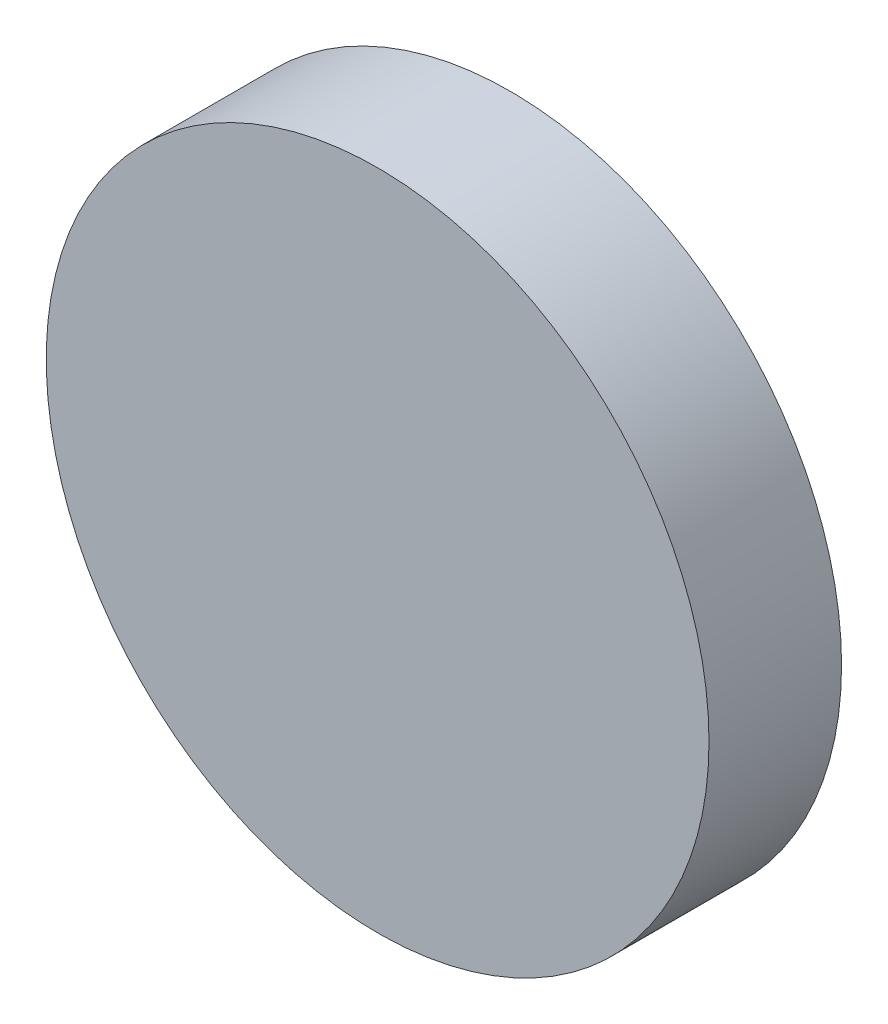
from build123d import *

# Parameters (mm, degrees)
SKETCH1_R      = 31.75
EXTRUDE1_DEPTH = 12.7


with BuildPart() as part:
    # Sketch1 → Extrude1 (new body)
    with BuildSketch(Plane.XY):
        Circle(SKETCH1_R)
    extrude(amount=EXTRUDE1_DEPTH)


solid = part.part
